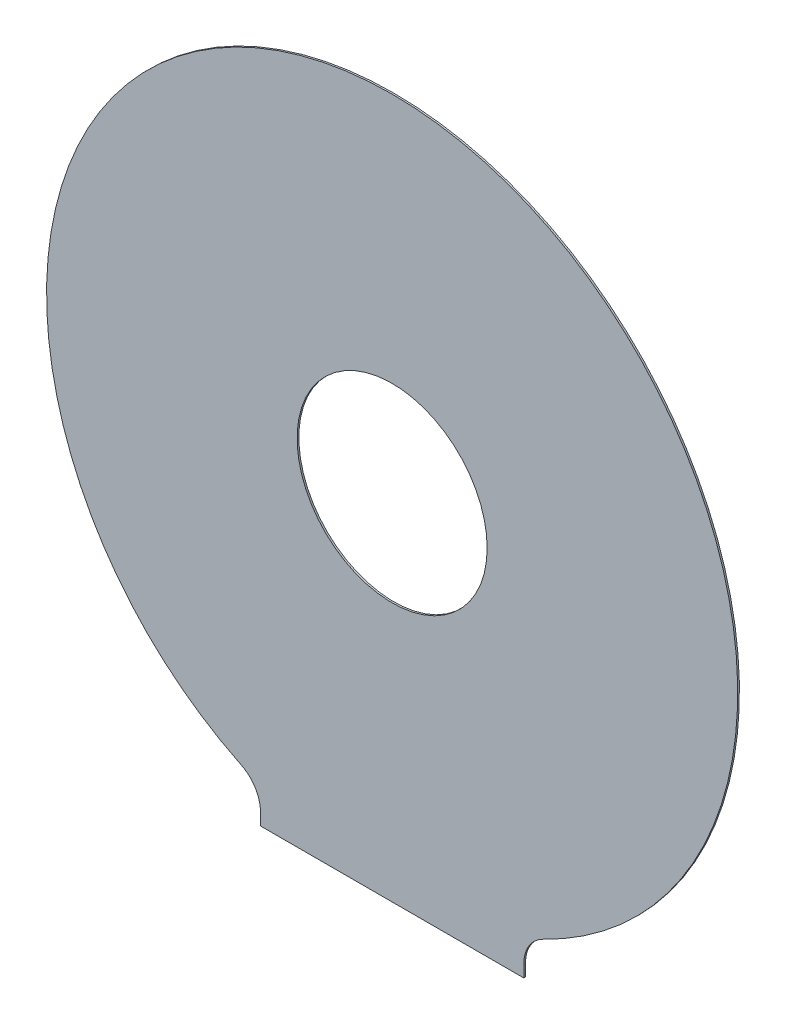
from build123d import *

# Parameters (mm, degrees)
SKETCH1_R           = 2.75
BOSS_EXTRUDE1_DEPTH = 0.05


with BuildPart() as part:
    # Sketch1 → Boss-Extrude1 (new body)
    with BuildSketch(Plane.XY):
        with BuildLine():
            Line((3.81, -10.245750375), (3.81, -9.89261846))
            ThreePointArc((3.81, -9.89261846), (3.962275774, -9.362181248), (4.372727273, -8.993289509))
            ThreePointArc((4.372727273, -8.993289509), (0, 10), (-4.372727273, -8.993289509))
            ThreePointArc((-4.372727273, -8.993289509), (-3.962275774, -9.362181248), (-3.81, -9.89261846))
            Line((-3.81, -9.89261846), (-3.81, -10.245750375))
            Line((-3.81, -10.245750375), (3.81, -10.245750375))
        make_face()
        Circle(SKETCH1_R, mode=Mode.SUBTRACT)
    extrude(amount=BOSS_EXTRUDE1_DEPTH)


solid = part.part
